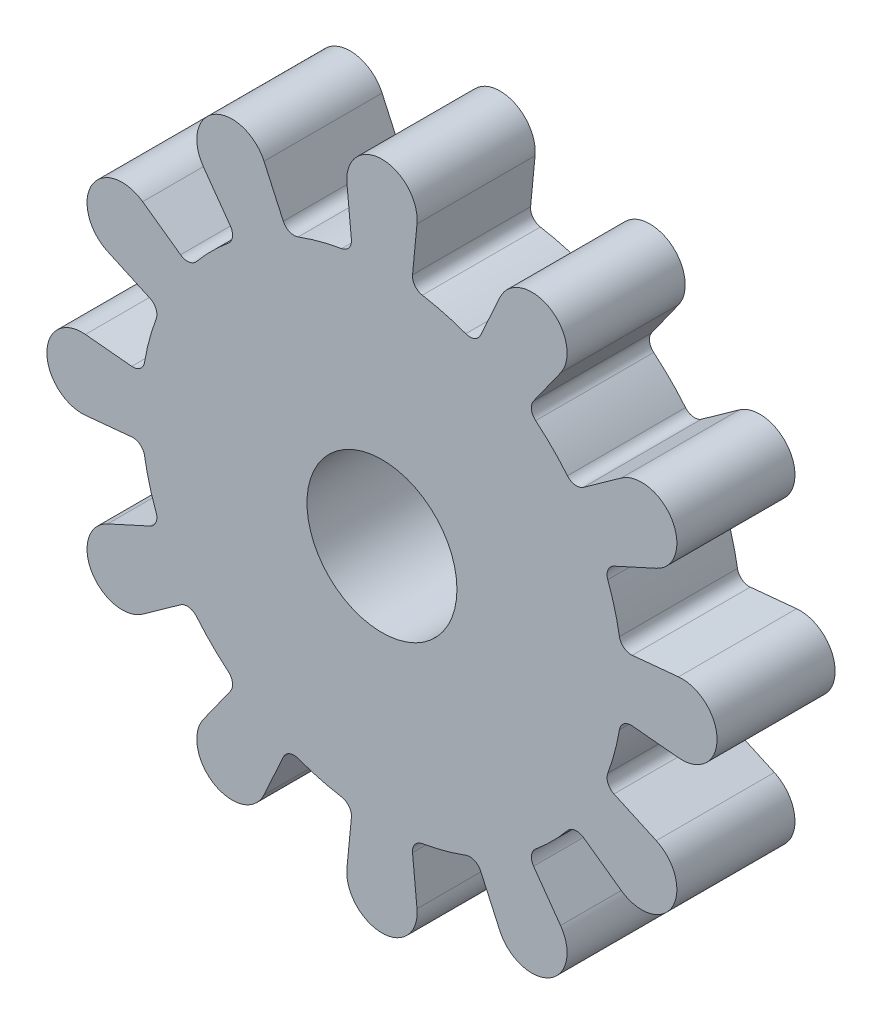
from build123d import *

# Parameters (mm, degrees)
SKETCH_1_R      = 6.35
EXTRUDE_1_DEPTH = 10


with BuildPart() as part:
    # Sketch 1 → Extrude 1 (new body)
    with BuildSketch(Plane.XY):
        with BuildLine():
            Line((-2.588749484, 21.193568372), (-2.966280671, 25.114379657))
            ThreePointArc((-2.966280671, 25.114379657), (0, 28.38), (2.966280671, 25.114379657))
            Line((2.966280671, 25.114379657), (2.588749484, 21.193568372))
            ThreePointArc((2.588749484, 21.193568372), (2.79004106, 20.489941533), (3.41666224, 20.111847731))
            ThreePointArc((3.41666224, 20.111847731), (5.27990852, 19.704886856), (7.09700757, 19.125702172))
            ThreePointArc((7.09700757, 19.125702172), (7.828724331, 19.13983042), (8.354861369, 19.648543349))
            Line((8.354861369, 19.648543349), (9.988315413, 23.232831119))
            ThreePointArc((9.988315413, 23.232831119), (14.19, 24.577800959), (15.126064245, 20.266550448))
            Line((15.126064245, 20.266550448), (12.838707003, 17.059793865))
            ThreePointArc((12.838707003, 17.059793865), (12.661217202, 16.34978936), (13.014840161, 15.709039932))
            ThreePointArc((13.014840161, 15.709039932), (14.424978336, 14.424978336), (15.709039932, 13.014840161))
            ThreePointArc((15.709039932, 13.014840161), (16.34978936, 12.661217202), (17.059793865, 12.838707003))
            Line((17.059793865, 12.838707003), (20.266550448, 15.126064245))
            ThreePointArc((20.266550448, 15.126064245), (24.577800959, 14.19), (23.232831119, 9.988315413))
            Line((23.232831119, 9.988315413), (19.648543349, 8.354861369))
            ThreePointArc((19.648543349, 8.354861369), (19.13983042, 7.828724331), (19.125702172, 7.09700757))
            ThreePointArc((19.125702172, 7.09700757), (19.704886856, 5.27990852), (20.111847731, 3.41666224))
            ThreePointArc((20.111847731, 3.41666224), (20.489941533, 2.79004106), (21.193568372, 2.588749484))
            Line((21.193568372, 2.588749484), (25.114379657, 2.966280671))
            ThreePointArc((25.114379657, 2.966280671), (28.38, 0), (25.114379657, -2.966280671))
            Line((25.114379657, -2.966280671), (21.193568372, -2.588749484))
            ThreePointArc((21.193568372, -2.588749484), (20.489941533, -2.79004106), (20.111847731, -3.41666224))
            ThreePointArc((20.111847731, -3.41666224), (19.704886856, -5.27990852), (19.125702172, -7.09700757))
            ThreePointArc((19.125702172, -7.09700757), (19.13983042, -7.828724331), (19.648543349, -8.354861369))
            Line((19.648543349, -8.354861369), (23.232831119, -9.988315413))
            ThreePointArc((23.232831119, -9.988315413), (24.577800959, -14.19), (20.266550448, -15.126064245))
            Line((20.266550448, -15.126064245), (17.059793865, -12.838707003))
            ThreePointArc((17.059793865, -12.838707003), (16.34978936, -12.661217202), (15.709039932, -13.014840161))
            ThreePointArc((15.709039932, -13.014840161), (14.424978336, -14.424978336), (13.014840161, -15.709039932))
            ThreePointArc((13.014840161, -15.709039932), (12.661217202, -16.34978936), (12.838707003, -17.059793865))
            Line((12.838707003, -17.059793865), (15.126064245, -20.266550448))
            ThreePointArc((15.126064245, -20.266550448), (14.19, -24.577800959), (9.988315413, -23.232831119))
            Line((9.988315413, -23.232831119), (8.354861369, -19.648543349))
            ThreePointArc((8.354861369, -19.648543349), (7.828724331, -19.13983042), (7.09700757, -19.125702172))
            ThreePointArc((7.09700757, -19.125702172), (5.27990852, -19.704886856), (3.41666224, -20.111847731))
            ThreePointArc((3.41666224, -20.111847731), (2.79004106, -20.489941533), (2.588749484, -21.193568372))
            Line((2.588749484, -21.193568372), (2.966280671, -25.114379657))
            ThreePointArc((2.966280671, -25.114379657), (0, -28.38), (-2.966280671, -25.114379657))
            Line((-2.966280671, -25.114379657), (-2.588749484, -21.193568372))
            ThreePointArc((-2.588749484, -21.193568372), (-2.79004106, -20.489941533), (-3.41666224, -20.111847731))
            ThreePointArc((-3.41666224, -20.111847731), (-5.27990852, -19.704886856), (-7.09700757, -19.125702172))
            ThreePointArc((-7.09700757, -19.125702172), (-7.828724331, -19.13983042), (-8.354861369, -19.648543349))
            Line((-8.354861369, -19.648543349), (-9.988315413, -23.232831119))
            ThreePointArc((-9.988315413, -23.232831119), (-14.19, -24.577800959), (-15.126064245, -20.266550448))
            Line((-15.126064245, -20.266550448), (-12.838707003, -17.059793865))
            ThreePointArc((-12.838707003, -17.059793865), (-12.661217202, -16.34978936), (-13.014840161, -15.709039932))
            ThreePointArc((-13.014840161, -15.709039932), (-14.424978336, -14.424978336), (-15.709039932, -13.014840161))
            ThreePointArc((-15.709039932, -13.014840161), (-16.34978936, -12.661217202), (-17.059793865, -12.838707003))
            Line((-17.059793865, -12.838707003), (-20.266550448, -15.126064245))
            ThreePointArc((-20.266550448, -15.126064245), (-24.577800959, -14.19), (-23.232831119, -9.988315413))
            Line((-23.232831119, -9.988315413), (-19.648543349, -8.354861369))
            ThreePointArc((-19.648543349, -8.354861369), (-19.13983042, -7.828724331), (-19.125702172, -7.09700757))
            ThreePointArc((-19.125702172, -7.09700757), (-19.704886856, -5.27990852), (-20.111847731, -3.41666224))
            ThreePointArc((-20.111847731, -3.41666224), (-20.489941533, -2.79004106), (-21.193568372, -2.588749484))
            Line((-21.193568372, -2.588749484), (-25.114379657, -2.966280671))
            ThreePointArc((-25.114379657, -2.966280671), (-28.38, 0), (-25.114379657, 2.966280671))
            Line((-25.114379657, 2.966280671), (-21.193568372, 2.588749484))
            ThreePointArc((-21.193568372, 2.588749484), (-20.489941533, 2.79004106), (-20.111847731, 3.41666224))
            ThreePointArc((-20.111847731, 3.41666224), (-19.704886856, 5.27990852), (-19.125702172, 7.09700757))
            ThreePointArc((-19.125702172, 7.09700757), (-19.13983042, 7.828724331), (-19.648543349, 8.354861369))
            Line((-19.648543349, 8.354861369), (-23.232831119, 9.988315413))
            ThreePointArc((-23.232831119, 9.988315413), (-24.577800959, 14.19), (-20.266550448, 15.126064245))
            Line((-20.266550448, 15.126064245), (-17.059793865, 12.838707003))
            ThreePointArc((-17.059793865, 12.838707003), (-16.34978936, 12.661217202), (-15.709039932, 13.014840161))
            ThreePointArc((-15.709039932, 13.014840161), (-14.424978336, 14.424978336), (-13.014840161, 15.709039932))
            ThreePointArc((-13.014840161, 15.709039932), (-12.661217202, 16.34978936), (-12.838707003, 17.059793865))
            Line((-12.838707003, 17.059793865), (-15.126064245, 20.266550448))
            ThreePointArc((-15.126064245, 20.266550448), (-14.19, 24.577800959), (-9.988315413, 23.232831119))
            Line((-9.988315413, 23.232831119), (-8.354861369, 19.648543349))
            ThreePointArc((-8.354861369, 19.648543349), (-7.828724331, 19.13983042), (-7.09700757, 19.125702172))
            ThreePointArc((-7.09700757, 19.125702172), (-5.27990852, 19.704886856), (-3.41666224, 20.111847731))
            ThreePointArc((-3.41666224, 20.111847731), (-2.79004106, 20.489941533), (-2.588749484, 21.193568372))
        make_face()
        Circle(SKETCH_1_R, mode=Mode.SUBTRACT)
    extrude(amount=EXTRUDE_1_DEPTH)


solid = part.part
